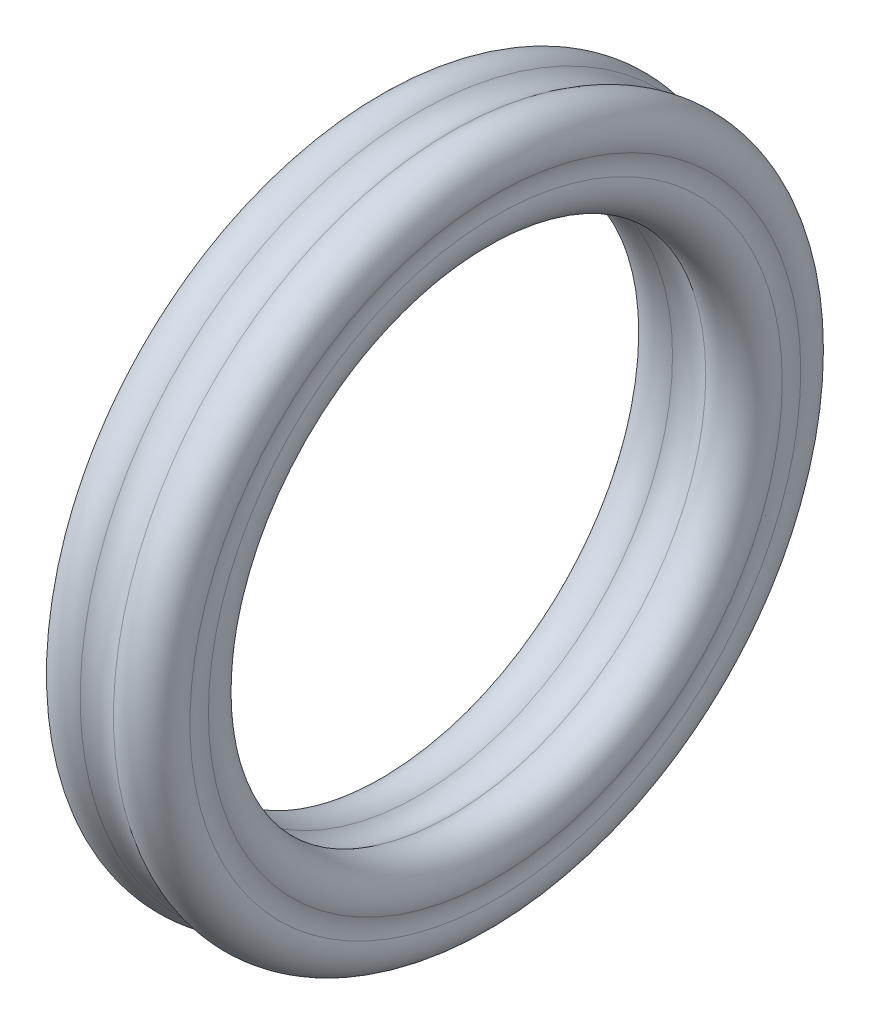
ISO-10303-21;
HEADER;
FILE_DESCRIPTION(('STEP AP214'),'2;1');
FILE_NAME('part.step','',(''),(''),'','','');
FILE_SCHEMA(('AUTOMOTIVE_DESIGN { 1 0 10303 214 1 1 1 1 }'));
ENDSEC;
DATA;
#1=APPLICATION_CONTEXT('core data for automotive mechanical design processes');
#2=APPLICATION_PROTOCOL_DEFINITION('international standard','automotive_design',2000,#1);
#3=PRODUCT_CONTEXT('',#1,'mechanical');
#4=PRODUCT('Part','Part','',(#3));
#5=PRODUCT_RELATED_PRODUCT_CATEGORY('part','',(#4));
#6=PRODUCT_DEFINITION_FORMATION('','',#4);
#7=PRODUCT_DEFINITION_CONTEXT('part definition',#1,'design');
#8=PRODUCT_DEFINITION('design','',#6,#7);
#9=PRODUCT_DEFINITION_SHAPE('','',#8);
#10=(LENGTH_UNIT() NAMED_UNIT(*) SI_UNIT(.MILLI.,.METRE.));
#11=(NAMED_UNIT(*) PLANE_ANGLE_UNIT() SI_UNIT($,.RADIAN.));
#12=(NAMED_UNIT(*) SI_UNIT($,.STERADIAN.) SOLID_ANGLE_UNIT());
#13=UNCERTAINTY_MEASURE_WITH_UNIT(LENGTH_MEASURE(1.E-05),#10,'distance_accuracy_value','');
#14=(GEOMETRIC_REPRESENTATION_CONTEXT(3) GLOBAL_UNCERTAINTY_ASSIGNED_CONTEXT((#13)) GLOBAL_UNIT_ASSIGNED_CONTEXT((#10,
#11,#12)) REPRESENTATION_CONTEXT('',''));
#15=CARTESIAN_POINT('',(0.,0.,0.));
#16=DIRECTION('',(0.,0.,1.));
#17=DIRECTION('',(1.,0.,0.));
#18=AXIS2_PLACEMENT_3D('',#15,#16,#17);
#19=CARTESIAN_POINT('',(16.2637058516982,0.,0.));
#20=DIRECTION('',(1.,0.,0.));
#21=DIRECTION('',(0.,0.,-1.));
#22=AXIS2_PLACEMENT_3D('',#19,#20,#21);
#23=TOROIDAL_SURFACE('',#22,4.78089815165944,0.463328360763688);
#24=CARTESIAN_POINT('',(15.8251887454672,0.,0.));
#25=DIRECTION('',(1.,0.,0.));
#26=DIRECTION('',(0.,0.,-1.));
#27=AXIS2_PLACEMENT_3D('',#24,#25,#26);
#28=CIRCLE('',#27,4.93048397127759);
#29=CARTESIAN_POINT('',(15.8251887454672,0.,-4.93048397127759));
#30=VERTEX_POINT('',#29);
#31=EDGE_CURVE('E10',#30,#30,#28,.T.);
#32=ORIENTED_EDGE('',*,*,#31,.T.);
#33=EDGE_LOOP('',(#32));
#34=FACE_BOUND('',#33,.T.);
#35=CARTESIAN_POINT('',(15.8251887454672,0.,0.));
#36=DIRECTION('',(1.,0.,0.));
#37=DIRECTION('',(0.,0.,-1.));
#38=AXIS2_PLACEMENT_3D('',#35,#36,#37);
#39=CIRCLE('',#38,4.63131233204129);
#40=CARTESIAN_POINT('',(15.8251887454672,0.,-4.63131233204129));
#41=VERTEX_POINT('',#40);
#42=EDGE_CURVE('E376',#41,#41,#39,.T.);
#43=ORIENTED_EDGE('',*,*,#42,.F.);
#44=EDGE_LOOP('',(#43));
#45=FACE_BOUND('',#44,.T.);
#46=ADVANCED_FACE('F348',(#34,#45),#23,.F.);
#47=CARTESIAN_POINT('',(15.3866716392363,0.,0.));
#48=DIRECTION('',(1.,0.,0.));
#49=DIRECTION('',(0.,0.,-1.));
#50=AXIS2_PLACEMENT_3D('',#47,#48,#49);
#51=TOROIDAL_SURFACE('',#50,5.08006979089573,0.463328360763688);
#52=CARTESIAN_POINT('',(15.1183358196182,0.,0.));
#53=DIRECTION('',(1.,0.,0.));
#54=DIRECTION('',(0.,0.,-1.));
#55=AXIS2_PLACEMENT_3D('',#52,#53,#54);
#56=CIRCLE('',#55,5.45778536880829);
#57=CARTESIAN_POINT('',(15.1183358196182,0.,-5.45778536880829));
#58=VERTEX_POINT('',#57);
#59=EDGE_CURVE('E354',#58,#58,#56,.T.);
#60=ORIENTED_EDGE('',*,*,#59,.T.);
#61=EDGE_LOOP('',(#60));
#62=FACE_BOUND('',#61,.T.);
#63=ORIENTED_EDGE('',*,*,#31,.F.);
#64=EDGE_LOOP('',(#63));
#65=FACE_BOUND('',#64,.T.);
#66=ADVANCED_FACE('F384',(#62,#65),#51,.T.);
#67=CARTESIAN_POINT('',(14.85,0.,0.));
#68=DIRECTION('',(1.,0.,0.));
#69=DIRECTION('',(0.,0.,-1.));
#70=AXIS2_PLACEMENT_3D('',#67,#68,#69);
#71=TOROIDAL_SURFACE('',#70,5.83550094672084,0.463328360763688);
#72=CARTESIAN_POINT('',(14.5816641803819,0.,0.));
#73=DIRECTION('',(1.,0.,0.));
#74=DIRECTION('',(0.,0.,-1.));
#75=AXIS2_PLACEMENT_3D('',#72,#73,#74);
#76=CIRCLE('',#75,5.45778536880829);
#77=CARTESIAN_POINT('',(14.5816641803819,0.,-5.45778536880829));
#78=VERTEX_POINT('',#77);
#79=EDGE_CURVE('E358',#78,#78,#76,.T.);
#80=ORIENTED_EDGE('',*,*,#79,.T.);
#81=EDGE_LOOP('',(#80));
#82=FACE_BOUND('',#81,.T.);
#83=ORIENTED_EDGE('',*,*,#59,.F.);
#84=EDGE_LOOP('',(#83));
#85=FACE_BOUND('',#84,.T.);
#86=ADVANCED_FACE('F388',(#82,#85),#71,.F.);
#87=CARTESIAN_POINT('',(14.3133283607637,0.,0.));
#88=DIRECTION('',(1.,0.,0.));
#89=DIRECTION('',(0.,0.,-1.));
#90=AXIS2_PLACEMENT_3D('',#87,#88,#89);
#91=TOROIDAL_SURFACE('',#90,5.08006979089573,0.463328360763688);
#92=CARTESIAN_POINT('',(13.8748112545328,0.,0.));
#93=DIRECTION('',(1.,0.,0.));
#94=DIRECTION('',(0.,0.,-1.));
#95=AXIS2_PLACEMENT_3D('',#92,#93,#94);
#96=CIRCLE('',#95,4.93048397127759);
#97=CARTESIAN_POINT('',(13.8748112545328,0.,-4.93048397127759));
#98=VERTEX_POINT('',#97);
#99=EDGE_CURVE('E362',#98,#98,#96,.T.);
#100=ORIENTED_EDGE('',*,*,#99,.T.);
#101=EDGE_LOOP('',(#100));
#102=FACE_BOUND('',#101,.T.);
#103=ORIENTED_EDGE('',*,*,#79,.F.);
#104=EDGE_LOOP('',(#103));
#105=FACE_BOUND('',#104,.T.);
#106=ADVANCED_FACE('F392',(#102,#105),#91,.T.);
#107=CARTESIAN_POINT('',(13.4362941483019,0.,0.));
#108=DIRECTION('',(1.,0.,0.));
#109=DIRECTION('',(0.,0.,-1.));
#110=AXIS2_PLACEMENT_3D('',#107,#108,#109);
#111=TOROIDAL_SURFACE('',#110,4.78089815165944,0.463328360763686);
#112=CARTESIAN_POINT('',(13.8748112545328,0.,0.));
#113=DIRECTION('',(1.,0.,0.));
#114=DIRECTION('',(0.,0.,-1.));
#115=AXIS2_PLACEMENT_3D('',#112,#113,#114);
#116=CIRCLE('',#115,4.63131233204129);
#117=CARTESIAN_POINT('',(13.8748112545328,0.,-4.63131233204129));
#118=VERTEX_POINT('',#117);
#119=EDGE_CURVE('E367',#118,#118,#116,.T.);
#120=ORIENTED_EDGE('',*,*,#119,.T.);
#121=EDGE_LOOP('',(#120));
#122=FACE_BOUND('',#121,.T.);
#123=ORIENTED_EDGE('',*,*,#99,.F.);
#124=EDGE_LOOP('',(#123));
#125=FACE_BOUND('',#124,.T.);
#126=ADVANCED_FACE('F399',(#122,#125),#111,.F.);
#127=CARTESIAN_POINT('',(14.3133283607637,0.,0.));
#128=DIRECTION('',(1.,0.,0.));
#129=DIRECTION('',(0.,0.,-1.));
#130=AXIS2_PLACEMENT_3D('',#127,#128,#129);
#131=TOROIDAL_SURFACE('',#130,4.48172651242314,0.463328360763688);
#132=CARTESIAN_POINT('',(14.5816641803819,0.,0.));
#133=DIRECTION('',(1.,0.,0.));
#134=DIRECTION('',(0.,0.,-1.));
#135=AXIS2_PLACEMENT_3D('',#132,#133,#134);
#136=CIRCLE('',#135,4.10401093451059);
#137=CARTESIAN_POINT('',(14.5816641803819,0.,-4.10401093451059));
#138=VERTEX_POINT('',#137);
#139=EDGE_CURVE('E370',#138,#138,#136,.T.);
#140=ORIENTED_EDGE('',*,*,#139,.T.);
#141=EDGE_LOOP('',(#140));
#142=FACE_BOUND('',#141,.T.);
#143=ORIENTED_EDGE('',*,*,#119,.F.);
#144=EDGE_LOOP('',(#143));
#145=FACE_BOUND('',#144,.T.);
#146=ADVANCED_FACE('F403',(#142,#145),#131,.T.);
#147=CARTESIAN_POINT('',(14.85,0.,0.));
#148=DIRECTION('',(1.,0.,0.));
#149=DIRECTION('',(0.,0.,-1.));
#150=AXIS2_PLACEMENT_3D('',#147,#148,#149);
#151=TOROIDAL_SURFACE('',#150,3.72629535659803,0.463328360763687);
#152=CARTESIAN_POINT('',(15.1183358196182,0.,0.));
#153=DIRECTION('',(1.,0.,0.));
#154=DIRECTION('',(0.,0.,-1.));
#155=AXIS2_PLACEMENT_3D('',#152,#153,#154);
#156=CIRCLE('',#155,4.10401093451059);
#157=CARTESIAN_POINT('',(15.1183358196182,0.,-4.10401093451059));
#158=VERTEX_POINT('',#157);
#159=EDGE_CURVE('E373',#158,#158,#156,.T.);
#160=ORIENTED_EDGE('',*,*,#159,.T.);
#161=EDGE_LOOP('',(#160));
#162=FACE_BOUND('',#161,.T.);
#163=ORIENTED_EDGE('',*,*,#139,.F.);
#164=EDGE_LOOP('',(#163));
#165=FACE_BOUND('',#164,.T.);
#166=ADVANCED_FACE('F407',(#162,#165),#151,.F.);
#167=CARTESIAN_POINT('',(15.3866716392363,0.,0.));
#168=DIRECTION('',(1.,0.,0.));
#169=DIRECTION('',(0.,0.,-1.));
#170=AXIS2_PLACEMENT_3D('',#167,#168,#169);
#171=TOROIDAL_SURFACE('',#170,4.48172651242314,0.463328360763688);
#172=ORIENTED_EDGE('',*,*,#42,.T.);
#173=EDGE_LOOP('',(#172));
#174=FACE_BOUND('',#173,.T.);
#175=ORIENTED_EDGE('',*,*,#159,.F.);
#176=EDGE_LOOP('',(#175));
#177=FACE_BOUND('',#176,.T.);
#178=ADVANCED_FACE('F380',(#174,#177),#171,.T.);
#179=CLOSED_SHELL('',(#46,#66,#86,#106,#126,#146,#166,#178));
#180=MANIFOLD_SOLID_BREP('B2',#179);
#181=ADVANCED_BREP_SHAPE_REPRESENTATION('',(#18,#180),#14);
#182=SHAPE_DEFINITION_REPRESENTATION(#9,#181);
ENDSEC;
END-ISO-10303-21;
